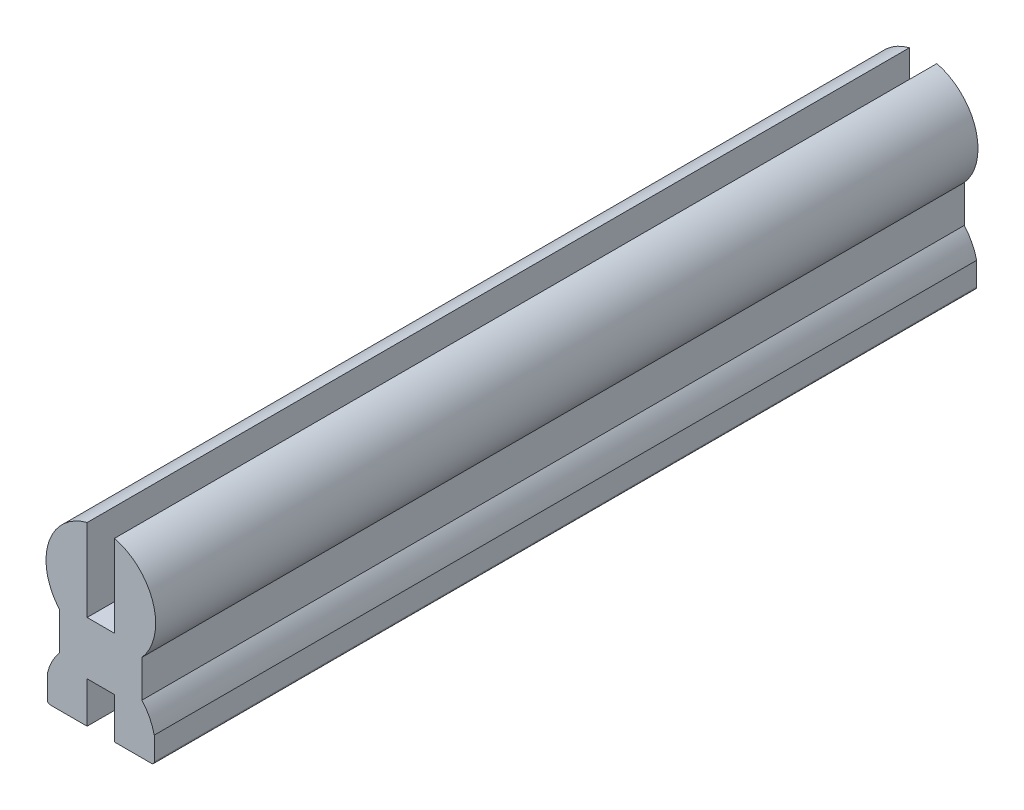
ISO-10303-21;
HEADER;
FILE_DESCRIPTION(('STEP AP214'),'2;1');
FILE_NAME('part.step','',(''),(''),'','','');
FILE_SCHEMA(('AUTOMOTIVE_DESIGN { 1 0 10303 214 1 1 1 1 }'));
ENDSEC;
DATA;
#1=APPLICATION_CONTEXT('core data for automotive mechanical design processes');
#2=APPLICATION_PROTOCOL_DEFINITION('international standard','automotive_design',2000,#1);
#3=PRODUCT_CONTEXT('',#1,'mechanical');
#4=PRODUCT('Part','Part','',(#3));
#5=PRODUCT_RELATED_PRODUCT_CATEGORY('part','',(#4));
#6=PRODUCT_DEFINITION_FORMATION('','',#4);
#7=PRODUCT_DEFINITION_CONTEXT('part definition',#1,'design');
#8=PRODUCT_DEFINITION('design','',#6,#7);
#9=PRODUCT_DEFINITION_SHAPE('','',#8);
#10=(LENGTH_UNIT() NAMED_UNIT(*) SI_UNIT(.MILLI.,.METRE.));
#11=(NAMED_UNIT(*) PLANE_ANGLE_UNIT() SI_UNIT($,.RADIAN.));
#12=(NAMED_UNIT(*) SI_UNIT($,.STERADIAN.) SOLID_ANGLE_UNIT());
#13=UNCERTAINTY_MEASURE_WITH_UNIT(LENGTH_MEASURE(1.E-05),#10,'distance_accuracy_value','');
#14=(GEOMETRIC_REPRESENTATION_CONTEXT(3) GLOBAL_UNCERTAINTY_ASSIGNED_CONTEXT((#13)) GLOBAL_UNIT_ASSIGNED_CONTEXT((#10,
#11,#12)) REPRESENTATION_CONTEXT('',''));
#15=CARTESIAN_POINT('',(0.,0.,0.));
#16=DIRECTION('',(0.,0.,1.));
#17=DIRECTION('',(1.,0.,0.));
#18=AXIS2_PLACEMENT_3D('',#15,#16,#17);
#19=CARTESIAN_POINT('',(0.,2.,-30.));
#20=DIRECTION('',(0.,0.,1.));
#21=DIRECTION('',(1.,0.,0.));
#22=AXIS2_PLACEMENT_3D('',#19,#20,#21);
#23=CYLINDRICAL_SURFACE('',#22,2.);
#24=CARTESIAN_POINT('',(0.,2.,0.));
#25=DIRECTION('',(0.,0.,1.));
#26=DIRECTION('',(1.,0.,0.));
#27=AXIS2_PLACEMENT_3D('',#24,#25,#26);
#28=CIRCLE('',#27,2.);
#29=CARTESIAN_POINT('',(1.5,0.677124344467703,0.));
#30=VERTEX_POINT('',#29);
#31=CARTESIAN_POINT('',(0.5,3.93649167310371,0.));
#32=VERTEX_POINT('',#31);
#33=EDGE_CURVE('E225',#30,#32,#28,.T.);
#34=ORIENTED_EDGE('',*,*,#33,.F.);
#35=DIRECTION('',(0.,0.,1.));
#36=VECTOR('',#35,1.);
#37=CARTESIAN_POINT('',(1.5,0.677124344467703,-30.));
#38=LINE('',#37,#36);
#39=CARTESIAN_POINT('',(1.5,0.677124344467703,-30.));
#40=VERTEX_POINT('',#39);
#41=EDGE_CURVE('E183',#40,#30,#38,.T.);
#42=ORIENTED_EDGE('',*,*,#41,.F.);
#43=CARTESIAN_POINT('',(0.,2.,-30.));
#44=DIRECTION('',(0.,0.,1.));
#45=DIRECTION('',(1.,0.,0.));
#46=AXIS2_PLACEMENT_3D('',#43,#44,#45);
#47=CIRCLE('',#46,2.);
#48=CARTESIAN_POINT('',(0.5,3.93649167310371,-30.));
#49=VERTEX_POINT('',#48);
#50=EDGE_CURVE('E177',#40,#49,#47,.T.);
#51=ORIENTED_EDGE('',*,*,#50,.T.);
#52=DIRECTION('',(0.,0.,1.));
#53=VECTOR('',#52,1.);
#54=CARTESIAN_POINT('',(0.5,3.93649167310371,-30.));
#55=LINE('',#54,#53);
#56=EDGE_CURVE('E159',#49,#32,#55,.T.);
#57=ORIENTED_EDGE('',*,*,#56,.T.);
#58=EDGE_LOOP('',(#34,#42,#51,#57));
#59=FACE_BOUND('',#58,.T.);
#60=ADVANCED_FACE('F34',(#59),#23,.T.);
#61=CARTESIAN_POINT('',(1.5,0.677124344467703,-30.));
#62=DIRECTION('',(1.,0.,0.));
#63=DIRECTION('',(0.,1.,0.));
#64=AXIS2_PLACEMENT_3D('',#61,#62,#63);
#65=PLANE('',#64);
#66=DIRECTION('',(0.,1.,0.));
#67=VECTOR('',#66,1.);
#68=CARTESIAN_POINT('',(1.5,0.677124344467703,0.));
#69=LINE('',#68,#67);
#70=CARTESIAN_POINT('',(1.5,-0.677124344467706,0.));
#71=VERTEX_POINT('',#70);
#72=EDGE_CURVE('E184',#71,#30,#69,.T.);
#73=ORIENTED_EDGE('',*,*,#72,.F.);
#74=DIRECTION('',(0.,0.,1.));
#75=VECTOR('',#74,1.);
#76=CARTESIAN_POINT('',(1.5,-0.677124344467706,-30.));
#77=LINE('',#76,#75);
#78=CARTESIAN_POINT('',(1.5,-0.677124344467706,-30.));
#79=VERTEX_POINT('',#78);
#80=EDGE_CURVE('E266',#79,#71,#77,.T.);
#81=ORIENTED_EDGE('',*,*,#80,.F.);
#82=DIRECTION('',(0.,1.,0.));
#83=VECTOR('',#82,1.);
#84=CARTESIAN_POINT('',(1.5,0.677124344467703,-30.));
#85=LINE('',#84,#83);
#86=EDGE_CURVE('E170',#79,#40,#85,.T.);
#87=ORIENTED_EDGE('',*,*,#86,.T.);
#88=ORIENTED_EDGE('',*,*,#41,.T.);
#89=EDGE_LOOP('',(#73,#81,#87,#88));
#90=FACE_BOUND('',#89,.T.);
#91=ADVANCED_FACE('F354',(#90),#65,.T.);
#92=CARTESIAN_POINT('',(0.,-2.,-30.));
#93=DIRECTION('',(0.,0.,1.));
#94=DIRECTION('',(1.,0.,0.));
#95=AXIS2_PLACEMENT_3D('',#92,#93,#94);
#96=CYLINDRICAL_SURFACE('',#95,2.);
#97=CARTESIAN_POINT('',(0.,-2.,0.));
#98=DIRECTION('',(0.,0.,1.));
#99=DIRECTION('',(1.,0.,0.));
#100=AXIS2_PLACEMENT_3D('',#97,#98,#99);
#101=CIRCLE('',#100,2.);
#102=CARTESIAN_POINT('',(1.95,-1.55559027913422,0.));
#103=VERTEX_POINT('',#102);
#104=EDGE_CURVE('E187',#103,#71,#101,.T.);
#105=ORIENTED_EDGE('',*,*,#104,.F.);
#106=DIRECTION('',(0.,0.,1.));
#107=VECTOR('',#106,1.);
#108=CARTESIAN_POINT('',(1.95,-1.55559027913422,-30.));
#109=LINE('',#108,#107);
#110=CARTESIAN_POINT('',(1.95,-1.55559027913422,-30.));
#111=VERTEX_POINT('',#110);
#112=EDGE_CURVE('E268',#111,#103,#109,.T.);
#113=ORIENTED_EDGE('',*,*,#112,.F.);
#114=CARTESIAN_POINT('',(0.,-2.,-30.));
#115=DIRECTION('',(0.,0.,1.));
#116=DIRECTION('',(1.,0.,0.));
#117=AXIS2_PLACEMENT_3D('',#114,#115,#116);
#118=CIRCLE('',#117,2.);
#119=EDGE_CURVE('E221',#111,#79,#118,.T.);
#120=ORIENTED_EDGE('',*,*,#119,.T.);
#121=ORIENTED_EDGE('',*,*,#80,.T.);
#122=EDGE_LOOP('',(#105,#113,#120,#121));
#123=FACE_BOUND('',#122,.T.);
#124=ADVANCED_FACE('F358',(#123),#96,.T.);
#125=CARTESIAN_POINT('',(1.95,-2.5,-30.));
#126=DIRECTION('',(1.,0.,0.));
#127=DIRECTION('',(0.,0.,-1.));
#128=AXIS2_PLACEMENT_3D('',#125,#126,#127);
#129=PLANE('',#128);
#130=DIRECTION('',(0.,1.,0.));
#131=VECTOR('',#130,1.);
#132=CARTESIAN_POINT('',(1.95,-2.5,0.));
#133=LINE('',#132,#131);
#134=CARTESIAN_POINT('',(1.95,-2.4,0.));
#135=VERTEX_POINT('',#134);
#136=EDGE_CURVE('E260',#135,#103,#133,.T.);
#137=ORIENTED_EDGE('',*,*,#136,.F.);
#138=DIRECTION('',(0.,0.,1.));
#139=VECTOR('',#138,1.);
#140=CARTESIAN_POINT('',(1.95,-2.4,-30.));
#141=LINE('',#140,#139);
#142=CARTESIAN_POINT('',(1.95,-2.4,-30.));
#143=VERTEX_POINT('',#142);
#144=EDGE_CURVE('E11',#135,#143,#141,.F.);
#145=ORIENTED_EDGE('',*,*,#144,.T.);
#146=DIRECTION('',(0.,1.,0.));
#147=VECTOR('',#146,1.);
#148=CARTESIAN_POINT('',(1.95,-2.5,-30.));
#149=LINE('',#148,#147);
#150=EDGE_CURVE('E219',#143,#111,#149,.T.);
#151=ORIENTED_EDGE('',*,*,#150,.T.);
#152=ORIENTED_EDGE('',*,*,#112,.T.);
#153=EDGE_LOOP('',(#137,#145,#151,#152));
#154=FACE_BOUND('',#153,.T.);
#155=ADVANCED_FACE('F359',(#154),#129,.T.);
#156=CARTESIAN_POINT('',(0.500000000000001,-2.5,-30.));
#157=DIRECTION('',(0.,-1.,0.));
#158=DIRECTION('',(1.,0.,0.));
#159=AXIS2_PLACEMENT_3D('',#156,#157,#158);
#160=PLANE('',#159);
#161=DIRECTION('',(1.,0.,0.));
#162=VECTOR('',#161,1.);
#163=CARTESIAN_POINT('',(0.500000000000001,-2.5,-30.));
#164=LINE('',#163,#162);
#165=CARTESIAN_POINT('',(0.500000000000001,-2.5,-30.));
#166=VERTEX_POINT('',#165);
#167=CARTESIAN_POINT('',(1.85,-2.5,-30.));
#168=VERTEX_POINT('',#167);
#169=EDGE_CURVE('E217',#166,#168,#164,.T.);
#170=ORIENTED_EDGE('',*,*,#169,.T.);
#171=DIRECTION('',(0.,0.,1.));
#172=VECTOR('',#171,1.);
#173=CARTESIAN_POINT('',(1.85,-2.5,-30.));
#174=LINE('',#173,#172);
#175=CARTESIAN_POINT('',(1.85,-2.5,0.));
#176=VERTEX_POINT('',#175);
#177=EDGE_CURVE('E42',#168,#176,#174,.T.);
#178=ORIENTED_EDGE('',*,*,#177,.T.);
#179=DIRECTION('',(1.,0.,0.));
#180=VECTOR('',#179,1.);
#181=CARTESIAN_POINT('',(0.500000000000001,-2.5,0.));
#182=LINE('',#181,#180);
#183=CARTESIAN_POINT('',(0.500000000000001,-2.5,0.));
#184=VERTEX_POINT('',#183);
#185=EDGE_CURVE('E257',#184,#176,#182,.T.);
#186=ORIENTED_EDGE('',*,*,#185,.F.);
#187=DIRECTION('',(0.,0.,1.));
#188=VECTOR('',#187,1.);
#189=CARTESIAN_POINT('',(0.500000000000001,-2.5,-30.));
#190=LINE('',#189,#188);
#191=EDGE_CURVE('E271',#166,#184,#190,.T.);
#192=ORIENTED_EDGE('',*,*,#191,.F.);
#193=EDGE_LOOP('',(#170,#178,#186,#192));
#194=FACE_BOUND('',#193,.T.);
#195=ADVANCED_FACE('F305',(#194),#160,.T.);
#196=CARTESIAN_POINT('',(0.5,-1.,-30.));
#197=DIRECTION('',(-1.,0.,0.));
#198=DIRECTION('',(0.,-1.,0.));
#199=AXIS2_PLACEMENT_3D('',#196,#197,#198);
#200=PLANE('',#199);
#201=DIRECTION('',(0.,-1.,0.));
#202=VECTOR('',#201,1.);
#203=CARTESIAN_POINT('',(0.5,-1.,0.));
#204=LINE('',#203,#202);
#205=CARTESIAN_POINT('',(0.5,-1.,0.));
#206=VERTEX_POINT('',#205);
#207=EDGE_CURVE('E254',#206,#184,#204,.T.);
#208=ORIENTED_EDGE('',*,*,#207,.F.);
#209=DIRECTION('',(0.,0.,1.));
#210=VECTOR('',#209,1.);
#211=CARTESIAN_POINT('',(0.5,-1.,-30.));
#212=LINE('',#211,#210);
#213=CARTESIAN_POINT('',(0.5,-1.,-30.));
#214=VERTEX_POINT('',#213);
#215=EDGE_CURVE('E273',#214,#206,#212,.T.);
#216=ORIENTED_EDGE('',*,*,#215,.F.);
#217=DIRECTION('',(0.,-1.,0.));
#218=VECTOR('',#217,1.);
#219=CARTESIAN_POINT('',(0.5,-1.,-30.));
#220=LINE('',#219,#218);
#221=EDGE_CURVE('E214',#214,#166,#220,.T.);
#222=ORIENTED_EDGE('',*,*,#221,.T.);
#223=ORIENTED_EDGE('',*,*,#191,.T.);
#224=EDGE_LOOP('',(#208,#216,#222,#223));
#225=FACE_BOUND('',#224,.T.);
#226=ADVANCED_FACE('F312',(#225),#200,.T.);
#227=CARTESIAN_POINT('',(-0.5,-1.,-30.));
#228=DIRECTION('',(0.,-1.,0.));
#229=DIRECTION('',(0.,0.,-1.));
#230=AXIS2_PLACEMENT_3D('',#227,#228,#229);
#231=PLANE('',#230);
#232=DIRECTION('',(1.,0.,0.));
#233=VECTOR('',#232,1.);
#234=CARTESIAN_POINT('',(-0.5,-1.,0.));
#235=LINE('',#234,#233);
#236=CARTESIAN_POINT('',(-0.5,-1.,0.));
#237=VERTEX_POINT('',#236);
#238=EDGE_CURVE('E251',#237,#206,#235,.T.);
#239=ORIENTED_EDGE('',*,*,#238,.F.);
#240=DIRECTION('',(0.,0.,1.));
#241=VECTOR('',#240,1.);
#242=CARTESIAN_POINT('',(-0.5,-1.,-30.));
#243=LINE('',#242,#241);
#244=CARTESIAN_POINT('',(-0.5,-1.,-30.));
#245=VERTEX_POINT('',#244);
#246=EDGE_CURVE('E275',#245,#237,#243,.T.);
#247=ORIENTED_EDGE('',*,*,#246,.F.);
#248=DIRECTION('',(1.,0.,0.));
#249=VECTOR('',#248,1.);
#250=CARTESIAN_POINT('',(-0.5,-1.,-30.));
#251=LINE('',#250,#249);
#252=EDGE_CURVE('E211',#245,#214,#251,.T.);
#253=ORIENTED_EDGE('',*,*,#252,.T.);
#254=ORIENTED_EDGE('',*,*,#215,.T.);
#255=EDGE_LOOP('',(#239,#247,#253,#254));
#256=FACE_BOUND('',#255,.T.);
#257=ADVANCED_FACE('F317',(#256),#231,.T.);
#258=CARTESIAN_POINT('',(-0.5,-1.,-30.));
#259=DIRECTION('',(1.,0.,0.));
#260=DIRECTION('',(0.,1.,0.));
#261=AXIS2_PLACEMENT_3D('',#258,#259,#260);
#262=PLANE('',#261);
#263=DIRECTION('',(0.,1.,0.));
#264=VECTOR('',#263,1.);
#265=CARTESIAN_POINT('',(-0.5,-1.,0.));
#266=LINE('',#265,#264);
#267=CARTESIAN_POINT('',(-0.5,-2.5,0.));
#268=VERTEX_POINT('',#267);
#269=EDGE_CURVE('E248',#268,#237,#266,.T.);
#270=ORIENTED_EDGE('',*,*,#269,.F.);
#271=DIRECTION('',(0.,0.,1.));
#272=VECTOR('',#271,1.);
#273=CARTESIAN_POINT('',(-0.5,-2.5,-30.));
#274=LINE('',#273,#272);
#275=CARTESIAN_POINT('',(-0.5,-2.5,-30.));
#276=VERTEX_POINT('',#275);
#277=EDGE_CURVE('E277',#276,#268,#274,.T.);
#278=ORIENTED_EDGE('',*,*,#277,.F.);
#279=DIRECTION('',(0.,1.,0.));
#280=VECTOR('',#279,1.);
#281=CARTESIAN_POINT('',(-0.5,-1.,-30.));
#282=LINE('',#281,#280);
#283=EDGE_CURVE('E208',#276,#245,#282,.T.);
#284=ORIENTED_EDGE('',*,*,#283,.T.);
#285=ORIENTED_EDGE('',*,*,#246,.T.);
#286=EDGE_LOOP('',(#270,#278,#284,#285));
#287=FACE_BOUND('',#286,.T.);
#288=ADVANCED_FACE('F320',(#287),#262,.T.);
#289=CARTESIAN_POINT('',(-1.95,-2.5,-30.));
#290=DIRECTION('',(0.,-1.,0.));
#291=DIRECTION('',(1.,0.,0.));
#292=AXIS2_PLACEMENT_3D('',#289,#290,#291);
#293=PLANE('',#292);
#294=DIRECTION('',(1.,0.,0.));
#295=VECTOR('',#294,1.);
#296=CARTESIAN_POINT('',(-1.95,-2.5,0.));
#297=LINE('',#296,#295);
#298=CARTESIAN_POINT('',(-1.85,-2.5,0.));
#299=VERTEX_POINT('',#298);
#300=EDGE_CURVE('E246',#299,#268,#297,.T.);
#301=ORIENTED_EDGE('',*,*,#300,.F.);
#302=DIRECTION('',(0.,0.,1.));
#303=VECTOR('',#302,1.);
#304=CARTESIAN_POINT('',(-1.85,-2.5,-30.));
#305=LINE('',#304,#303);
#306=CARTESIAN_POINT('',(-1.85,-2.5,-30.));
#307=VERTEX_POINT('',#306);
#308=EDGE_CURVE('E297',#299,#307,#305,.F.);
#309=ORIENTED_EDGE('',*,*,#308,.T.);
#310=DIRECTION('',(1.,0.,0.));
#311=VECTOR('',#310,1.);
#312=CARTESIAN_POINT('',(-1.95,-2.5,-30.));
#313=LINE('',#312,#311);
#314=EDGE_CURVE('E206',#307,#276,#313,.T.);
#315=ORIENTED_EDGE('',*,*,#314,.T.);
#316=ORIENTED_EDGE('',*,*,#277,.T.);
#317=EDGE_LOOP('',(#301,#309,#315,#316));
#318=FACE_BOUND('',#317,.T.);
#319=ADVANCED_FACE('F385',(#318),#293,.T.);
#320=CARTESIAN_POINT('',(-1.95,-2.5,-30.));
#321=DIRECTION('',(-1.,0.,0.));
#322=DIRECTION('',(0.,0.,1.));
#323=AXIS2_PLACEMENT_3D('',#320,#321,#322);
#324=PLANE('',#323);
#325=DIRECTION('',(0.,-1.,0.));
#326=VECTOR('',#325,1.);
#327=CARTESIAN_POINT('',(-1.95,-2.5,-30.));
#328=LINE('',#327,#326);
#329=CARTESIAN_POINT('',(-1.95,-1.55559027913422,-30.));
#330=VERTEX_POINT('',#329);
#331=CARTESIAN_POINT('',(-1.95,-2.4,-30.));
#332=VERTEX_POINT('',#331);
#333=EDGE_CURVE('E203',#330,#332,#328,.T.);
#334=ORIENTED_EDGE('',*,*,#333,.T.);
#335=DIRECTION('',(0.,0.,1.));
#336=VECTOR('',#335,1.);
#337=CARTESIAN_POINT('',(-1.95,-2.4,-30.));
#338=LINE('',#337,#336);
#339=CARTESIAN_POINT('',(-1.95,-2.4,0.));
#340=VERTEX_POINT('',#339);
#341=EDGE_CURVE('E265',#332,#340,#338,.T.);
#342=ORIENTED_EDGE('',*,*,#341,.T.);
#343=DIRECTION('',(0.,-1.,0.));
#344=VECTOR('',#343,1.);
#345=CARTESIAN_POINT('',(-1.95,-2.5,0.));
#346=LINE('',#345,#344);
#347=CARTESIAN_POINT('',(-1.95,-1.55559027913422,0.));
#348=VERTEX_POINT('',#347);
#349=EDGE_CURVE('E243',#348,#340,#346,.T.);
#350=ORIENTED_EDGE('',*,*,#349,.F.);
#351=DIRECTION('',(0.,0.,1.));
#352=VECTOR('',#351,1.);
#353=CARTESIAN_POINT('',(-1.95,-1.55559027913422,-30.));
#354=LINE('',#353,#352);
#355=EDGE_CURVE('E280',#330,#348,#354,.T.);
#356=ORIENTED_EDGE('',*,*,#355,.F.);
#357=EDGE_LOOP('',(#334,#342,#350,#356));
#358=FACE_BOUND('',#357,.T.);
#359=ADVANCED_FACE('F331',(#358),#324,.T.);
#360=CARTESIAN_POINT('',(0.,-2.,-30.));
#361=DIRECTION('',(0.,0.,1.));
#362=DIRECTION('',(1.,0.,0.));
#363=AXIS2_PLACEMENT_3D('',#360,#361,#362);
#364=CYLINDRICAL_SURFACE('',#363,2.);
#365=CARTESIAN_POINT('',(0.,-2.,0.));
#366=DIRECTION('',(0.,0.,1.));
#367=DIRECTION('',(1.,0.,0.));
#368=AXIS2_PLACEMENT_3D('',#365,#366,#367);
#369=CIRCLE('',#368,2.);
#370=CARTESIAN_POINT('',(-1.5,-0.677124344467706,0.));
#371=VERTEX_POINT('',#370);
#372=EDGE_CURVE('E240',#371,#348,#369,.T.);
#373=ORIENTED_EDGE('',*,*,#372,.F.);
#374=DIRECTION('',(0.,0.,1.));
#375=VECTOR('',#374,1.);
#376=CARTESIAN_POINT('',(-1.5,-0.677124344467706,-30.));
#377=LINE('',#376,#375);
#378=CARTESIAN_POINT('',(-1.5,-0.677124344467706,-30.));
#379=VERTEX_POINT('',#378);
#380=EDGE_CURVE('E282',#379,#371,#377,.T.);
#381=ORIENTED_EDGE('',*,*,#380,.F.);
#382=CARTESIAN_POINT('',(0.,-2.,-30.));
#383=DIRECTION('',(0.,0.,1.));
#384=DIRECTION('',(1.,0.,0.));
#385=AXIS2_PLACEMENT_3D('',#382,#383,#384);
#386=CIRCLE('',#385,2.);
#387=EDGE_CURVE('E200',#379,#330,#386,.T.);
#388=ORIENTED_EDGE('',*,*,#387,.T.);
#389=ORIENTED_EDGE('',*,*,#355,.T.);
#390=EDGE_LOOP('',(#373,#381,#388,#389));
#391=FACE_BOUND('',#390,.T.);
#392=ADVANCED_FACE('F336',(#391),#364,.T.);
#393=CARTESIAN_POINT('',(-1.5,0.677124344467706,-30.));
#394=DIRECTION('',(-1.,0.,0.));
#395=DIRECTION('',(0.,0.,1.));
#396=AXIS2_PLACEMENT_3D('',#393,#394,#395);
#397=PLANE('',#396);
#398=DIRECTION('',(0.,-1.,0.));
#399=VECTOR('',#398,1.);
#400=CARTESIAN_POINT('',(-1.5,0.677124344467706,0.));
#401=LINE('',#400,#399);
#402=CARTESIAN_POINT('',(-1.5,0.677124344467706,0.));
#403=VERTEX_POINT('',#402);
#404=EDGE_CURVE('E237',#403,#371,#401,.T.);
#405=ORIENTED_EDGE('',*,*,#404,.F.);
#406=DIRECTION('',(0.,0.,1.));
#407=VECTOR('',#406,1.);
#408=CARTESIAN_POINT('',(-1.5,0.677124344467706,-30.));
#409=LINE('',#408,#407);
#410=CARTESIAN_POINT('',(-1.5,0.677124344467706,-30.));
#411=VERTEX_POINT('',#410);
#412=EDGE_CURVE('E284',#411,#403,#409,.T.);
#413=ORIENTED_EDGE('',*,*,#412,.F.);
#414=DIRECTION('',(0.,-1.,0.));
#415=VECTOR('',#414,1.);
#416=CARTESIAN_POINT('',(-1.5,0.677124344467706,-30.));
#417=LINE('',#416,#415);
#418=EDGE_CURVE('E197',#411,#379,#417,.T.);
#419=ORIENTED_EDGE('',*,*,#418,.T.);
#420=ORIENTED_EDGE('',*,*,#380,.T.);
#421=EDGE_LOOP('',(#405,#413,#419,#420));
#422=FACE_BOUND('',#421,.T.);
#423=ADVANCED_FACE('F341',(#422),#397,.T.);
#424=CARTESIAN_POINT('',(0.,2.,-30.));
#425=DIRECTION('',(0.,0.,1.));
#426=DIRECTION('',(1.,0.,0.));
#427=AXIS2_PLACEMENT_3D('',#424,#425,#426);
#428=CYLINDRICAL_SURFACE('',#427,2.);
#429=CARTESIAN_POINT('',(0.,2.,0.));
#430=DIRECTION('',(0.,0.,1.));
#431=DIRECTION('',(1.,0.,0.));
#432=AXIS2_PLACEMENT_3D('',#429,#430,#431);
#433=CIRCLE('',#432,2.);
#434=CARTESIAN_POINT('',(-0.500000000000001,3.93649167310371,0.));
#435=VERTEX_POINT('',#434);
#436=EDGE_CURVE('E234',#435,#403,#433,.T.);
#437=ORIENTED_EDGE('',*,*,#436,.F.);
#438=DIRECTION('',(0.,0.,1.));
#439=VECTOR('',#438,1.);
#440=CARTESIAN_POINT('',(-0.500000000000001,3.93649167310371,-30.));
#441=LINE('',#440,#439);
#442=CARTESIAN_POINT('',(-0.500000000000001,3.93649167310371,-30.));
#443=VERTEX_POINT('',#442);
#444=EDGE_CURVE('E286',#443,#435,#441,.T.);
#445=ORIENTED_EDGE('',*,*,#444,.F.);
#446=CARTESIAN_POINT('',(0.,2.,-30.));
#447=DIRECTION('',(0.,0.,1.));
#448=DIRECTION('',(1.,0.,0.));
#449=AXIS2_PLACEMENT_3D('',#446,#447,#448);
#450=CIRCLE('',#449,2.);
#451=EDGE_CURVE('E194',#443,#411,#450,.T.);
#452=ORIENTED_EDGE('',*,*,#451,.T.);
#453=ORIENTED_EDGE('',*,*,#412,.T.);
#454=EDGE_LOOP('',(#437,#445,#452,#453));
#455=FACE_BOUND('',#454,.T.);
#456=ADVANCED_FACE('F344',(#455),#428,.T.);
#457=CARTESIAN_POINT('',(-0.500000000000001,3.93649167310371,-30.));
#458=DIRECTION('',(1.,0.,0.));
#459=DIRECTION('',(0.,1.,0.));
#460=AXIS2_PLACEMENT_3D('',#457,#458,#459);
#461=PLANE('',#460);
#462=DIRECTION('',(0.,1.,0.));
#463=VECTOR('',#462,1.);
#464=CARTESIAN_POINT('',(-0.500000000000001,3.93649167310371,0.));
#465=LINE('',#464,#463);
#466=CARTESIAN_POINT('',(-0.5,0.936491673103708,0.));
#467=VERTEX_POINT('',#466);
#468=EDGE_CURVE('E231',#467,#435,#465,.T.);
#469=ORIENTED_EDGE('',*,*,#468,.F.);
#470=DIRECTION('',(0.,0.,1.));
#471=VECTOR('',#470,1.);
#472=CARTESIAN_POINT('',(-0.5,0.936491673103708,-30.));
#473=LINE('',#472,#471);
#474=CARTESIAN_POINT('',(-0.5,0.936491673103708,-30.));
#475=VERTEX_POINT('',#474);
#476=EDGE_CURVE('E288',#475,#467,#473,.T.);
#477=ORIENTED_EDGE('',*,*,#476,.F.);
#478=DIRECTION('',(0.,1.,0.));
#479=VECTOR('',#478,1.);
#480=CARTESIAN_POINT('',(-0.500000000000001,3.93649167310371,-30.));
#481=LINE('',#480,#479);
#482=EDGE_CURVE('E191',#475,#443,#481,.T.);
#483=ORIENTED_EDGE('',*,*,#482,.T.);
#484=ORIENTED_EDGE('',*,*,#444,.T.);
#485=EDGE_LOOP('',(#469,#477,#483,#484));
#486=FACE_BOUND('',#485,.T.);
#487=ADVANCED_FACE('F347',(#486),#461,.T.);
#488=CARTESIAN_POINT('',(-0.5,0.936491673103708,-30.));
#489=DIRECTION('',(0.,1.,0.));
#490=DIRECTION('',(0.,0.,1.));
#491=AXIS2_PLACEMENT_3D('',#488,#489,#490);
#492=PLANE('',#491);
#493=DIRECTION('',(-1.,0.,0.));
#494=VECTOR('',#493,1.);
#495=CARTESIAN_POINT('',(-0.5,0.936491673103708,0.));
#496=LINE('',#495,#494);
#497=CARTESIAN_POINT('',(0.5,0.936491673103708,0.));
#498=VERTEX_POINT('',#497);
#499=EDGE_CURVE('E228',#498,#467,#496,.T.);
#500=ORIENTED_EDGE('',*,*,#499,.F.);
#501=DIRECTION('',(0.,0.,1.));
#502=VECTOR('',#501,1.);
#503=CARTESIAN_POINT('',(0.5,0.936491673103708,-30.));
#504=LINE('',#503,#502);
#505=CARTESIAN_POINT('',(0.5,0.936491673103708,-30.));
#506=VERTEX_POINT('',#505);
#507=EDGE_CURVE('E169',#506,#498,#504,.T.);
#508=ORIENTED_EDGE('',*,*,#507,.F.);
#509=DIRECTION('',(-1.,0.,0.));
#510=VECTOR('',#509,1.);
#511=CARTESIAN_POINT('',(-0.5,0.936491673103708,-30.));
#512=LINE('',#511,#510);
#513=EDGE_CURVE('E181',#506,#475,#512,.T.);
#514=ORIENTED_EDGE('',*,*,#513,.T.);
#515=ORIENTED_EDGE('',*,*,#476,.T.);
#516=EDGE_LOOP('',(#500,#508,#514,#515));
#517=FACE_BOUND('',#516,.T.);
#518=ADVANCED_FACE('F350',(#517),#492,.T.);
#519=CARTESIAN_POINT('',(0.5,0.936491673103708,-30.));
#520=DIRECTION('',(-1.,0.,0.));
#521=DIRECTION('',(0.,0.,1.));
#522=AXIS2_PLACEMENT_3D('',#519,#520,#521);
#523=PLANE('',#522);
#524=DIRECTION('',(0.,-1.,0.));
#525=VECTOR('',#524,1.);
#526=CARTESIAN_POINT('',(0.5,0.936491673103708,0.));
#527=LINE('',#526,#525);
#528=EDGE_CURVE('E164',#32,#498,#527,.T.);
#529=ORIENTED_EDGE('',*,*,#528,.F.);
#530=ORIENTED_EDGE('',*,*,#56,.F.);
#531=DIRECTION('',(0.,-1.,0.));
#532=VECTOR('',#531,1.);
#533=CARTESIAN_POINT('',(0.5,0.936491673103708,-30.));
#534=LINE('',#533,#532);
#535=EDGE_CURVE('E162',#49,#506,#534,.T.);
#536=ORIENTED_EDGE('',*,*,#535,.T.);
#537=ORIENTED_EDGE('',*,*,#507,.T.);
#538=EDGE_LOOP('',(#529,#530,#536,#537));
#539=FACE_BOUND('',#538,.T.);
#540=ADVANCED_FACE('F161',(#539),#523,.T.);
#541=CARTESIAN_POINT('',(0.,2.,-30.));
#542=DIRECTION('',(0.,0.,1.));
#543=DIRECTION('',(1.,0.,0.));
#544=AXIS2_PLACEMENT_3D('',#541,#542,#543);
#545=PLANE('',#544);
#546=ORIENTED_EDGE('',*,*,#314,.F.);
#547=CARTESIAN_POINT('',(-1.85,-2.4,-30.));
#548=DIRECTION('',(0.,0.,1.));
#549=DIRECTION('',(1.,0.,0.));
#550=AXIS2_PLACEMENT_3D('',#547,#548,#549);
#551=CIRCLE('',#550,0.1);
#552=EDGE_CURVE('E300',#307,#332,#551,.F.);
#553=ORIENTED_EDGE('',*,*,#552,.T.);
#554=ORIENTED_EDGE('',*,*,#333,.F.);
#555=ORIENTED_EDGE('',*,*,#387,.F.);
#556=ORIENTED_EDGE('',*,*,#418,.F.);
#557=ORIENTED_EDGE('',*,*,#451,.F.);
#558=ORIENTED_EDGE('',*,*,#482,.F.);
#559=ORIENTED_EDGE('',*,*,#513,.F.);
#560=ORIENTED_EDGE('',*,*,#535,.F.);
#561=ORIENTED_EDGE('',*,*,#50,.F.);
#562=ORIENTED_EDGE('',*,*,#86,.F.);
#563=ORIENTED_EDGE('',*,*,#119,.F.);
#564=ORIENTED_EDGE('',*,*,#150,.F.);
#565=CARTESIAN_POINT('',(1.85,-2.4,-30.));
#566=DIRECTION('',(0.,0.,1.));
#567=DIRECTION('',(1.,0.,0.));
#568=AXIS2_PLACEMENT_3D('',#565,#566,#567);
#569=CIRCLE('',#568,0.1);
#570=EDGE_CURVE('E49',#143,#168,#569,.F.);
#571=ORIENTED_EDGE('',*,*,#570,.T.);
#572=ORIENTED_EDGE('',*,*,#169,.F.);
#573=ORIENTED_EDGE('',*,*,#221,.F.);
#574=ORIENTED_EDGE('',*,*,#252,.F.);
#575=ORIENTED_EDGE('',*,*,#283,.F.);
#576=EDGE_LOOP('',(#546,#553,#554,#555,#556,#557,#558,#559,#560,#561,#562,#563,#564,#571,#572,
#573,#574,#575));
#577=FACE_BOUND('',#576,.T.);
#578=ADVANCED_FACE('F175',(#577),#545,.F.);
#579=CARTESIAN_POINT('',(0.,2.,0.));
#580=DIRECTION('',(0.,0.,1.));
#581=DIRECTION('',(1.,0.,0.));
#582=AXIS2_PLACEMENT_3D('',#579,#580,#581);
#583=PLANE('',#582);
#584=ORIENTED_EDGE('',*,*,#349,.T.);
#585=CARTESIAN_POINT('',(-1.85,-2.4,0.));
#586=DIRECTION('',(0.,0.,1.));
#587=DIRECTION('',(1.,0.,0.));
#588=AXIS2_PLACEMENT_3D('',#585,#586,#587);
#589=CIRCLE('',#588,0.1);
#590=EDGE_CURVE('E295',#340,#299,#589,.T.);
#591=ORIENTED_EDGE('',*,*,#590,.T.);
#592=ORIENTED_EDGE('',*,*,#300,.T.);
#593=ORIENTED_EDGE('',*,*,#269,.T.);
#594=ORIENTED_EDGE('',*,*,#238,.T.);
#595=ORIENTED_EDGE('',*,*,#207,.T.);
#596=ORIENTED_EDGE('',*,*,#185,.T.);
#597=CARTESIAN_POINT('',(1.85,-2.4,0.));
#598=DIRECTION('',(0.,0.,1.));
#599=DIRECTION('',(1.,0.,0.));
#600=AXIS2_PLACEMENT_3D('',#597,#598,#599);
#601=CIRCLE('',#600,0.1);
#602=EDGE_CURVE('E293',#176,#135,#601,.T.);
#603=ORIENTED_EDGE('',*,*,#602,.T.);
#604=ORIENTED_EDGE('',*,*,#136,.T.);
#605=ORIENTED_EDGE('',*,*,#104,.T.);
#606=ORIENTED_EDGE('',*,*,#72,.T.);
#607=ORIENTED_EDGE('',*,*,#33,.T.);
#608=ORIENTED_EDGE('',*,*,#528,.T.);
#609=ORIENTED_EDGE('',*,*,#499,.T.);
#610=ORIENTED_EDGE('',*,*,#468,.T.);
#611=ORIENTED_EDGE('',*,*,#436,.T.);
#612=ORIENTED_EDGE('',*,*,#404,.T.);
#613=ORIENTED_EDGE('',*,*,#372,.T.);
#614=EDGE_LOOP('',(#584,#591,#592,#593,#594,#595,#596,#603,#604,#605,#606,#607,#608,#609,#610,
#611,#612,#613));
#615=FACE_BOUND('',#614,.T.);
#616=ADVANCED_FACE('F308',(#615),#583,.T.);
#617=CARTESIAN_POINT('',(-1.85,-2.4,-30.));
#618=DIRECTION('',(0.,0.,1.));
#619=DIRECTION('',(1.,0.,0.));
#620=AXIS2_PLACEMENT_3D('',#617,#618,#619);
#621=CYLINDRICAL_SURFACE('',#620,0.1);
#622=ORIENTED_EDGE('',*,*,#552,.F.);
#623=ORIENTED_EDGE('',*,*,#308,.F.);
#624=ORIENTED_EDGE('',*,*,#590,.F.);
#625=ORIENTED_EDGE('',*,*,#341,.F.);
#626=EDGE_LOOP('',(#622,#623,#624,#625));
#627=FACE_BOUND('',#626,.T.);
#628=ADVANCED_FACE('F328',(#627),#621,.T.);
#629=CARTESIAN_POINT('',(1.85,-2.4,-30.));
#630=DIRECTION('',(0.,0.,1.));
#631=DIRECTION('',(1.,0.,0.));
#632=AXIS2_PLACEMENT_3D('',#629,#630,#631);
#633=CYLINDRICAL_SURFACE('',#632,0.1);
#634=ORIENTED_EDGE('',*,*,#570,.F.);
#635=ORIENTED_EDGE('',*,*,#144,.F.);
#636=ORIENTED_EDGE('',*,*,#602,.F.);
#637=ORIENTED_EDGE('',*,*,#177,.F.);
#638=EDGE_LOOP('',(#634,#635,#636,#637));
#639=FACE_BOUND('',#638,.T.);
#640=ADVANCED_FACE('F36',(#639),#633,.T.);
#641=CLOSED_SHELL('',(#60,#91,#124,#155,#195,#226,#257,#288,#319,#359,#392,#423,#456,#487,#518,
#540,#578,#616,#628,#640));
#642=MANIFOLD_SOLID_BREP('B2',#641);
#643=ADVANCED_BREP_SHAPE_REPRESENTATION('',(#18,#642),#14);
#644=SHAPE_DEFINITION_REPRESENTATION(#9,#643);
ENDSEC;
END-ISO-10303-21;
